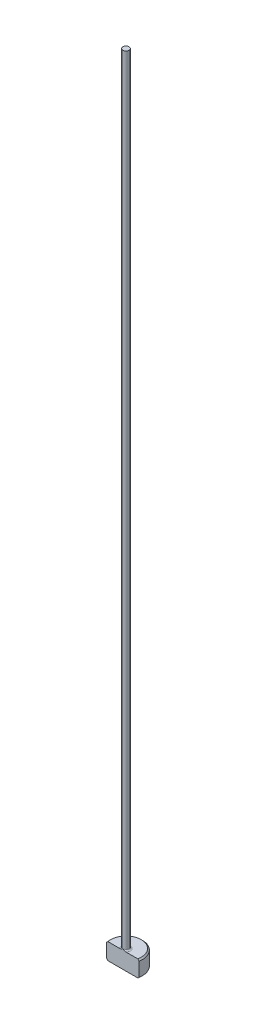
ISO-10303-21;
HEADER;
FILE_DESCRIPTION(('STEP AP214'),'2;1');
FILE_NAME('part.step','',(''),(''),'','','');
FILE_SCHEMA(('AUTOMOTIVE_DESIGN { 1 0 10303 214 1 1 1 1 }'));
ENDSEC;
DATA;
#1=APPLICATION_CONTEXT('core data for automotive mechanical design processes');
#2=APPLICATION_PROTOCOL_DEFINITION('international standard','automotive_design',2000,#1);
#3=PRODUCT_CONTEXT('',#1,'mechanical');
#4=PRODUCT('Part','Part','',(#3));
#5=PRODUCT_RELATED_PRODUCT_CATEGORY('part','',(#4));
#6=PRODUCT_DEFINITION_FORMATION('','',#4);
#7=PRODUCT_DEFINITION_CONTEXT('part definition',#1,'design');
#8=PRODUCT_DEFINITION('design','',#6,#7);
#9=PRODUCT_DEFINITION_SHAPE('','',#8);
#10=(LENGTH_UNIT() NAMED_UNIT(*) SI_UNIT(.MILLI.,.METRE.));
#11=(NAMED_UNIT(*) PLANE_ANGLE_UNIT() SI_UNIT($,.RADIAN.));
#12=(NAMED_UNIT(*) SI_UNIT($,.STERADIAN.) SOLID_ANGLE_UNIT());
#13=UNCERTAINTY_MEASURE_WITH_UNIT(LENGTH_MEASURE(1.E-05),#10,'distance_accuracy_value','');
#14=(GEOMETRIC_REPRESENTATION_CONTEXT(3) GLOBAL_UNCERTAINTY_ASSIGNED_CONTEXT((#13)) GLOBAL_UNIT_ASSIGNED_CONTEXT((#10,
#11,#12)) REPRESENTATION_CONTEXT('',''));
#15=CARTESIAN_POINT('',(0.,0.,0.));
#16=DIRECTION('',(0.,0.,1.));
#17=DIRECTION('',(1.,0.,0.));
#18=AXIS2_PLACEMENT_3D('',#15,#16,#17);
#19=CARTESIAN_POINT('',(0.,0.,0.));
#20=DIRECTION('',(0.,-1.,0.));
#21=DIRECTION('',(0.,0.,-1.));
#22=AXIS2_PLACEMENT_3D('',#19,#20,#21);
#23=PLANE('',#22);
#24=CARTESIAN_POINT('',(0.,0.,0.));
#25=DIRECTION('',(0.,-1.,0.));
#26=DIRECTION('',(0.,0.,-1.));
#27=AXIS2_PLACEMENT_3D('',#24,#25,#26);
#28=CIRCLE('',#27,2.92099999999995);
#29=CARTESIAN_POINT('',(-2.85989111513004,0.,0.594359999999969));
#30=VERTEX_POINT('',#29);
#31=CARTESIAN_POINT('',(2.85989111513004,0.,0.594359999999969));
#32=VERTEX_POINT('',#31);
#33=EDGE_CURVE('E98',#30,#32,#28,.T.);
#34=ORIENTED_EDGE('',*,*,#33,.T.);
#35=DIRECTION('',(-1.,0.,0.));
#36=VECTOR('',#35,1.);
#37=CARTESIAN_POINT('',(-3.11887178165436,0.,0.594359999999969));
#38=LINE('',#37,#36);
#39=EDGE_CURVE('E83',#32,#30,#38,.T.);
#40=ORIENTED_EDGE('',*,*,#39,.T.);
#41=EDGE_LOOP('',(#34,#40));
#42=FACE_BOUND('',#41,.T.);
#43=ADVANCED_FACE('F32',(#42),#23,.T.);
#44=CARTESIAN_POINT('',(0.,259.958771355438,0.));
#45=DIRECTION('',(0.,1.,0.));
#46=DIRECTION('',(0.,0.,1.));
#47=AXIS2_PLACEMENT_3D('',#44,#45,#46);
#48=CYLINDRICAL_SURFACE('',#47,3.17499999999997);
#49=CARTESIAN_POINT('',(0.,2.92099999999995,0.));
#50=DIRECTION('',(0.,1.,0.));
#51=DIRECTION('',(0.,0.,1.));
#52=AXIS2_PLACEMENT_3D('',#49,#50,#51);
#53=CIRCLE('',#52,3.17499999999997);
#54=CARTESIAN_POINT('',(-3.11887178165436,2.92099999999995,0.594359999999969));
#55=VERTEX_POINT('',#54);
#56=CARTESIAN_POINT('',(3.11887178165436,2.92099999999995,0.594359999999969));
#57=VERTEX_POINT('',#56);
#58=EDGE_CURVE('E104',#55,#57,#53,.F.);
#59=ORIENTED_EDGE('',*,*,#58,.T.);
#60=DIRECTION('',(0.,-1.,0.));
#61=VECTOR('',#60,1.);
#62=CARTESIAN_POINT('',(3.11887178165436,152.4,0.594359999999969));
#63=LINE('',#62,#61);
#64=CARTESIAN_POINT('',(3.11887178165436,0.254000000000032,0.594359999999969));
#65=VERTEX_POINT('',#64);
#66=EDGE_CURVE('E183',#57,#65,#63,.T.);
#67=ORIENTED_EDGE('',*,*,#66,.T.);
#68=CARTESIAN_POINT('',(0.,0.254000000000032,0.));
#69=DIRECTION('',(0.,-1.,0.));
#70=DIRECTION('',(0.,0.,-1.));
#71=AXIS2_PLACEMENT_3D('',#68,#69,#70);
#72=CIRCLE('',#71,3.17499999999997);
#73=CARTESIAN_POINT('',(-3.11887178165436,0.254000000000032,0.594359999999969));
#74=VERTEX_POINT('',#73);
#75=EDGE_CURVE('E100',#65,#74,#72,.F.);
#76=ORIENTED_EDGE('',*,*,#75,.T.);
#77=DIRECTION('',(0.,-1.,0.));
#78=VECTOR('',#77,1.);
#79=CARTESIAN_POINT('',(-3.11887178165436,152.4,0.594359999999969));
#80=LINE('',#79,#78);
#81=EDGE_CURVE('E93',#55,#74,#80,.T.);
#82=ORIENTED_EDGE('',*,*,#81,.F.);
#83=EDGE_LOOP('',(#59,#67,#76,#82));
#84=FACE_BOUND('',#83,.T.);
#85=ADVANCED_FACE('F158',(#84),#48,.T.);
#86=CARTESIAN_POINT('',(-3.17499999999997,3.175,0.));
#87=DIRECTION('',(0.,1.,0.));
#88=DIRECTION('',(0.,0.,1.));
#89=AXIS2_PLACEMENT_3D('',#86,#87,#88);
#90=PLANE('',#89);
#91=CARTESIAN_POINT('',(0.,3.175,0.));
#92=DIRECTION('',(0.,1.,0.));
#93=DIRECTION('',(0.,0.,1.));
#94=AXIS2_PLACEMENT_3D('',#91,#92,#93);
#95=CIRCLE('',#94,2.92099999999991);
#96=CARTESIAN_POINT('',(2.85989111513,3.175,0.594359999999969));
#97=VERTEX_POINT('',#96);
#98=CARTESIAN_POINT('',(-2.85989111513,3.175,0.594359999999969));
#99=VERTEX_POINT('',#98);
#100=EDGE_CURVE('E178',#97,#99,#95,.T.);
#101=ORIENTED_EDGE('',*,*,#100,.T.);
#102=DIRECTION('',(1.,0.,0.));
#103=VECTOR('',#102,1.);
#104=CARTESIAN_POINT('',(-3.17499999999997,3.175,0.594359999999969));
#105=LINE('',#104,#103);
#106=CARTESIAN_POINT('',(-0.605351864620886,3.17500000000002,0.594359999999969));
#107=VERTEX_POINT('',#106);
#108=EDGE_CURVE('E57',#99,#107,#105,.T.);
#109=ORIENTED_EDGE('',*,*,#108,.T.);
#110=CARTESIAN_POINT('',(0.,3.175,0.));
#111=DIRECTION('',(0.,1.,0.));
#112=DIRECTION('',(0.,0.,1.));
#113=AXIS2_PLACEMENT_3D('',#110,#111,#112);
#114=CIRCLE('',#113,0.848359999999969);
#115=CARTESIAN_POINT('',(0.605351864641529,3.17500000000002,0.594359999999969));
#116=VERTEX_POINT('',#115);
#117=EDGE_CURVE('E107',#107,#116,#114,.F.);
#118=ORIENTED_EDGE('',*,*,#117,.T.);
#119=EDGE_CURVE('E136',#116,#97,#105,.T.);
#120=ORIENTED_EDGE('',*,*,#119,.T.);
#121=EDGE_LOOP('',(#101,#109,#118,#120));
#122=FACE_BOUND('',#121,.T.);
#123=ADVANCED_FACE('F147',(#122),#90,.T.);
#124=CARTESIAN_POINT('',(0.,3.17499999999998,0.));
#125=DIRECTION('',(0.,-1.,0.));
#126=DIRECTION('',(0.,0.,-1.));
#127=AXIS2_PLACEMENT_3D('',#124,#125,#126);
#128=CONICAL_SURFACE('',#127,2.92099999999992,0.785398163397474);
#129=ORIENTED_EDGE('',*,*,#58,.F.);
#130=CARTESIAN_POINT('',(-6.8648194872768,-0.794501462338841,0.594359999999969));
#131=CARTESIAN_POINT('',(-6.6191711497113,-0.549776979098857,0.594359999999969));
#132=CARTESIAN_POINT('',(-6.37348172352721,-0.305093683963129,0.594359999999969));
#133=CARTESIAN_POINT('',(-5.88194851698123,0.184148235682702,0.594359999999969));
#134=CARTESIAN_POINT('',(-5.63610472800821,0.428706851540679,0.594359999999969));
#135=CARTESIAN_POINT('',(-5.14385611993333,0.917989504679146,0.594359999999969));
#136=CARTESIAN_POINT('',(-4.89745100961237,1.16271324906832,0.594359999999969));
#137=CARTESIAN_POINT('',(-4.40434968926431,1.65183765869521,0.594359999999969));
#138=CARTESIAN_POINT('',(-4.15765349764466,1.89623834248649,0.594359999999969));
#139=CARTESIAN_POINT('',(-3.67893599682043,2.36952748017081,0.594359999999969));
#140=CARTESIAN_POINT('',(-3.44694459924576,2.59844615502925,0.594359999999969));
#141=CARTESIAN_POINT('',(-3.09833846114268,2.94123712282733,0.594359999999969));
#142=CARTESIAN_POINT('',(-2.9820226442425,3.05541328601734,0.594359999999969));
#143=CARTESIAN_POINT('',(-2.74910931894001,3.28347396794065,0.594359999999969));
#144=CARTESIAN_POINT('',(-2.63251181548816,3.3973584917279,0.594359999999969));
#145=CARTESIAN_POINT('',(-2.39900931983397,3.62460667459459,0.594359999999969));
#146=CARTESIAN_POINT('',(-2.28210468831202,3.73797070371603,0.594359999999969));
#147=CARTESIAN_POINT('',(-2.04765692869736,3.96405258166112,0.594359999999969));
#148=CARTESIAN_POINT('',(-1.93011375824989,4.07677038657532,0.594359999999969));
#149=CARTESIAN_POINT('',(-1.69404304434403,4.30110221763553,0.594359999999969));
#150=CARTESIAN_POINT('',(-1.57551582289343,4.412716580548,0.594359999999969));
#151=CARTESIAN_POINT('',(-1.39631926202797,4.57860871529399,0.594359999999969));
#152=CARTESIAN_POINT('',(-1.33635609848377,4.63364822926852,0.594359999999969));
#153=CARTESIAN_POINT('',(-1.21575339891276,4.74298001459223,0.594359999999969));
#154=CARTESIAN_POINT('',(-1.15511388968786,4.7972723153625,0.594359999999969));
#155=CARTESIAN_POINT('',(-1.05978852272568,4.88102982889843,0.594359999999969));
#156=CARTESIAN_POINT('',(-1.02544763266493,4.91088723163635,0.594359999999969));
#157=CARTESIAN_POINT('',(-0.95635921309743,4.9701360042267,0.594359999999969));
#158=CARTESIAN_POINT('',(-0.921611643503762,4.99952732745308,0.594359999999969));
#159=CARTESIAN_POINT('',(-0.851219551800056,5.05799717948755,0.594359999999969));
#160=CARTESIAN_POINT('',(-0.815569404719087,5.08706896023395,0.594359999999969));
#161=CARTESIAN_POINT('',(-0.743573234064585,5.14432373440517,0.594359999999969));
#162=CARTESIAN_POINT('',(-0.707227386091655,5.17250694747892,0.594359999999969));
#163=CARTESIAN_POINT('',(-0.633142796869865,5.22794418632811,0.594359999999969));
#164=CARTESIAN_POINT('',(-0.595392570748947,5.25518299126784,0.594359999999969));
#165=CARTESIAN_POINT('',(-0.518500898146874,5.30776394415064,0.594359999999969));
#166=CARTESIAN_POINT('',(-0.479357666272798,5.33310351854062,0.594359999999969));
#167=CARTESIAN_POINT('',(-0.399651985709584,5.38048073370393,0.594359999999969));
#168=CARTESIAN_POINT('',(-0.359109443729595,5.40255109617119,0.594359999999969));
#169=CARTESIAN_POINT('',(-0.275782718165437,5.44180529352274,0.594359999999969));
#170=CARTESIAN_POINT('',(-0.233006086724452,5.45900447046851,0.594359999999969));
#171=CARTESIAN_POINT('',(-0.148687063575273,5.48450569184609,0.594359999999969));
#172=CARTESIAN_POINT('',(-0.107352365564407,5.49344321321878,0.594359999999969));
#173=CARTESIAN_POINT('',(-0.0447378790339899,5.50032302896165,0.594359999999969));
#174=CARTESIAN_POINT('',(-0.0238027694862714,5.50153223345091,0.594359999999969));
#175=CARTESIAN_POINT('',(0.0180770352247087,5.50173397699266,0.594359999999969));
#176=CARTESIAN_POINT('',(0.0390217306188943,5.50072645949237,0.594359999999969));
#177=CARTESIAN_POINT('',(0.101294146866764,5.49447119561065,0.594359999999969));
#178=CARTESIAN_POINT('',(0.142325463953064,5.48601867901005,0.594359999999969));
#179=CARTESIAN_POINT('',(0.202429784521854,5.46841556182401,0.594359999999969));
#180=CARTESIAN_POINT('',(0.222297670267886,5.46169167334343,0.594359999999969));
#181=CARTESIAN_POINT('',(0.261527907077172,5.44689786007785,0.594359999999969));
#182=CARTESIAN_POINT('',(0.280890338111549,5.43882814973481,0.594359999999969));
#183=CARTESIAN_POINT('',(0.334163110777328,5.41482918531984,0.594359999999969));
#184=CARTESIAN_POINT('',(0.367533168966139,5.39771168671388,0.594359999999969));
#185=CARTESIAN_POINT('',(0.432986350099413,5.36114954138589,0.594359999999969));
#186=CARTESIAN_POINT('',(0.465067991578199,5.34170231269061,0.594359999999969));
#187=CARTESIAN_POINT('',(0.528309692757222,5.30115132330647,0.594359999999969));
#188=CARTESIAN_POINT('',(0.559466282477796,5.28004220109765,0.594359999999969));
#189=CARTESIAN_POINT('',(0.620984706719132,5.2366907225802,0.594359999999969));
#190=CARTESIAN_POINT('',(0.651346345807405,5.21444809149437,0.594359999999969));
#191=CARTESIAN_POINT('',(0.742070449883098,5.14609257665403,0.594359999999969));
#192=CARTESIAN_POINT('',(0.801494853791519,5.09874004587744,0.594359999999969));
#193=CARTESIAN_POINT('',(0.918675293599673,5.002317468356,0.594359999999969));
#194=CARTESIAN_POINT('',(0.976434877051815,4.95325165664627,0.594359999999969));
#195=CARTESIAN_POINT('',(1.08971968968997,4.85504334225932,0.594359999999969));
#196=CARTESIAN_POINT('',(1.1452662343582,4.80592537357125,0.594359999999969));
#197=CARTESIAN_POINT('',(1.25569925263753,4.70695340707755,0.594359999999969));
#198=CARTESIAN_POINT('',(1.31058570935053,4.65709939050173,0.594359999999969));
#199=CARTESIAN_POINT('',(1.474563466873,4.5067643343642,0.594359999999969));
#200=CARTESIAN_POINT('',(1.58295757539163,4.40552404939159,0.594359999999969));
#201=CARTESIAN_POINT('',(1.79884367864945,4.20183719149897,0.594359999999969));
#202=CARTESIAN_POINT('',(1.9063344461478,4.09938932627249,0.594359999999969));
#203=CARTESIAN_POINT('',(2.1206627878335,3.89382966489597,0.594359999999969));
#204=CARTESIAN_POINT('',(2.22750041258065,3.79071792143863,0.594359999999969));
#205=CARTESIAN_POINT('',(2.43977439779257,3.58500662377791,0.594359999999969));
#206=CARTESIAN_POINT('',(2.54521462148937,3.48241104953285,0.594359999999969));
#207=CARTESIAN_POINT('',(2.75580702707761,3.27692056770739,0.594359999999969));
#208=CARTESIAN_POINT('',(2.86095920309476,3.17402565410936,0.594359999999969));
#209=CARTESIAN_POINT('',(3.17601133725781,2.86511932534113,0.594359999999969));
#210=CARTESIAN_POINT('',(3.38560260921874,2.65879322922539,0.594359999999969));
#211=CARTESIAN_POINT('',(3.86691725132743,2.18392087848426,0.594359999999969));
#212=CARTESIAN_POINT('',(4.13848251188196,1.91521456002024,0.594359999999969));
#213=CARTESIAN_POINT('',(4.6812293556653,1.37732631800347,0.594359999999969));
#214=CARTESIAN_POINT('',(4.95241086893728,1.10814432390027,0.594359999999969));
#215=CARTESIAN_POINT('',(5.49725341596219,0.566796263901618,0.594359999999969));
#216=CARTESIAN_POINT('',(5.77091180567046,0.29462753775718,0.594359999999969));
#217=CARTESIAN_POINT('',(6.31800243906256,-0.249845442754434,0.594359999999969));
#218=CARTESIAN_POINT('',(6.59143471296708,-0.522149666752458,0.594359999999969));
#219=CARTESIAN_POINT('',(6.8648194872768,-0.794501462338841,0.594359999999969));
#220=B_SPLINE_CURVE_WITH_KNOTS('',3,(#130,#131,#132,#133,#134,#135,#136,#137,#138,#139,#140,
#141,#142,#143,#144,#145,#146,#147,#148,#149,#150,#151,#152,#153,#154,#155,#156,#157,#158,#159,
#160,#161,#162,#163,#164,#165,#166,#167,#168,#169,#170,#171,#172,#173,#174,#175,#176,#177,#178,
#179,#180,#181,#182,#183,#184,#185,#186,#187,#188,#189,#190,#191,#192,#193,#194,#195,#196,#197,
#198,#199,#200,#201,#202,#203,#204,#205,#206,#207,#208,#209,#210,#211,#212,#213,#214,#215,#216,
#217,#218,#219),.UNSPECIFIED.,.F.,.F.,(4,2,2,2,2,2,2,2,2,2,2,2,2,2,2,2,2,2,2,2,2,2,2,2,2,2,2,2,
2,2,2,2,2,2,2,2,2,2,2,2,2,2,2,2,4),(0.,1.04023973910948,2.0805438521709,3.12239139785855,
4.16417625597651,5.14193457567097,5.63090260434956,6.11986210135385,6.60839150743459,
7.09695372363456,7.58536191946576,7.8295393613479,8.0737071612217,8.21022095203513,
8.34674831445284,8.48474175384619,8.62270081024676,8.76231642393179,8.90211792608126,
9.04040873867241,9.17825902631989,9.3043114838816,9.3671106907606,9.42991149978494,
9.55472897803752,9.61762313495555,9.68050727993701,9.79286939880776,9.90535721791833,
10.0182241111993,10.131118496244,10.3589904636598,10.5863342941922,10.8087690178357,
11.0312094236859,11.4761525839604,11.9216253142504,12.3670631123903,12.8084142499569,
13.2497743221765,14.1320939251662,15.2781982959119,16.4244899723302,17.5823683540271,
18.7400526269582),.UNSPECIFIED.);
#221=EDGE_CURVE('E135',#55,#99,#220,.T.);
#222=ORIENTED_EDGE('',*,*,#221,.T.);
#223=ORIENTED_EDGE('',*,*,#100,.F.);
#224=EDGE_CURVE('E127',#97,#57,#220,.T.);
#225=ORIENTED_EDGE('',*,*,#224,.T.);
#226=EDGE_LOOP('',(#129,#222,#223,#225));
#227=FACE_BOUND('',#226,.T.);
#228=ADVANCED_FACE('F143',(#227),#128,.T.);
#229=CARTESIAN_POINT('',(0.,0.254000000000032,0.));
#230=DIRECTION('',(0.,1.,0.));
#231=DIRECTION('',(0.,0.,1.));
#232=AXIS2_PLACEMENT_3D('',#229,#230,#231);
#233=CONICAL_SURFACE('',#232,3.17499999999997,0.785398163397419);
#234=ORIENTED_EDGE('',*,*,#75,.F.);
#235=CARTESIAN_POINT('',(6.8648194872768,3.96950146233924,0.594359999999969));
#236=CARTESIAN_POINT('',(6.61917114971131,3.72477697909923,0.594359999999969));
#237=CARTESIAN_POINT('',(6.37348172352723,3.48009368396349,0.594359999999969));
#238=CARTESIAN_POINT('',(5.88194851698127,2.99085176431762,0.594359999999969));
#239=CARTESIAN_POINT('',(5.63610472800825,2.74629314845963,0.594359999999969));
#240=CARTESIAN_POINT('',(5.14385611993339,2.25701049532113,0.594359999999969));
#241=CARTESIAN_POINT('',(4.89745100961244,2.01228675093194,0.594359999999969));
#242=CARTESIAN_POINT('',(4.4043496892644,1.52316234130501,0.594359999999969));
#243=CARTESIAN_POINT('',(4.15765349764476,1.27876165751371,0.594359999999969));
#244=CARTESIAN_POINT('',(3.67893599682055,0.805472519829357,0.594359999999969));
#245=CARTESIAN_POINT('',(3.44694459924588,0.576553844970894,0.594359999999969));
#246=CARTESIAN_POINT('',(3.09833846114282,0.233762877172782,0.594359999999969));
#247=CARTESIAN_POINT('',(2.98202264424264,0.119586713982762,0.594359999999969));
#248=CARTESIAN_POINT('',(2.74910931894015,-0.108473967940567,0.594359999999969));
#249=CARTESIAN_POINT('',(2.6325118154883,-0.222358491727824,0.594359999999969));
#250=CARTESIAN_POINT('',(2.39900931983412,-0.44960667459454,0.594359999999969));
#251=CARTESIAN_POINT('',(2.28210468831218,-0.562970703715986,0.594359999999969));
#252=CARTESIAN_POINT('',(2.04765692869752,-0.789052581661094,0.594359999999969));
#253=CARTESIAN_POINT('',(1.93011375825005,-0.901770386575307,0.594359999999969));
#254=CARTESIAN_POINT('',(1.6940430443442,-1.12610221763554,0.594359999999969));
#255=CARTESIAN_POINT('',(1.5755158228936,-1.23771658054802,0.594359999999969));
#256=CARTESIAN_POINT('',(1.39631926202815,-1.40360871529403,0.594359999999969));
#257=CARTESIAN_POINT('',(1.33635609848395,-1.45864822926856,0.594359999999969));
#258=CARTESIAN_POINT('',(1.21575339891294,-1.56798001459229,0.594359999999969));
#259=CARTESIAN_POINT('',(1.15511388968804,-1.62227231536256,0.594359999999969));
#260=CARTESIAN_POINT('',(1.05978852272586,-1.7060298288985,0.594359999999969));
#261=CARTESIAN_POINT('',(1.02544763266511,-1.73588723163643,0.594359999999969));
#262=CARTESIAN_POINT('',(0.956359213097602,-1.7951360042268,0.594359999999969));
#263=CARTESIAN_POINT('',(0.92161164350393,-1.82452732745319,0.594359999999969));
#264=CARTESIAN_POINT('',(0.851219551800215,-1.88299717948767,0.594359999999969));
#265=CARTESIAN_POINT('',(0.815569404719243,-1.91206896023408,0.594359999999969));
#266=CARTESIAN_POINT('',(0.743573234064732,-1.96932373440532,0.594359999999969));
#267=CARTESIAN_POINT('',(0.707227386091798,-1.99750694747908,0.594359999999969));
#268=CARTESIAN_POINT('',(0.633142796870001,-2.05294418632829,0.594359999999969));
#269=CARTESIAN_POINT('',(0.595392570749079,-2.08018299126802,0.594359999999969));
#270=CARTESIAN_POINT('',(0.518500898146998,-2.13276394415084,0.594359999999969));
#271=CARTESIAN_POINT('',(0.479357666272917,-2.15810351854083,0.594359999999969));
#272=CARTESIAN_POINT('',(0.399651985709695,-2.20548073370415,0.594359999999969));
#273=CARTESIAN_POINT('',(0.359109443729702,-2.22755109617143,0.594359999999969));
#274=CARTESIAN_POINT('',(0.275782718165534,-2.26680529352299,0.594359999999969));
#275=CARTESIAN_POINT('',(0.233006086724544,-2.28400447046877,0.594359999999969));
#276=CARTESIAN_POINT('',(0.14868706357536,-2.30950569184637,0.594359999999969));
#277=CARTESIAN_POINT('',(0.107352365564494,-2.31844321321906,0.594359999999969));
#278=CARTESIAN_POINT('',(0.0447378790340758,-2.32532302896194,0.594359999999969));
#279=CARTESIAN_POINT('',(0.0238027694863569,-2.32653223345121,0.594359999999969));
#280=CARTESIAN_POINT('',(-0.0180770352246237,-2.32673397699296,0.594359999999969));
#281=CARTESIAN_POINT('',(-0.0390217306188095,-2.32572645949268,0.594359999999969));
#282=CARTESIAN_POINT('',(-0.101294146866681,-2.31947119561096,0.594359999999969));
#283=CARTESIAN_POINT('',(-0.142325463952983,-2.31101867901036,0.594359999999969));
#284=CARTESIAN_POINT('',(-0.202429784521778,-2.29341556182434,0.594359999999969));
#285=CARTESIAN_POINT('',(-0.222297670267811,-2.28669167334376,0.594359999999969));
#286=CARTESIAN_POINT('',(-0.261527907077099,-2.27189786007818,0.594359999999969));
#287=CARTESIAN_POINT('',(-0.280890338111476,-2.26382814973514,0.594359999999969));
#288=CARTESIAN_POINT('',(-0.334163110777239,-2.23982918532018,0.594359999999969));
#289=CARTESIAN_POINT('',(-0.367533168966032,-2.22271168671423,0.594359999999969));
#290=CARTESIAN_POINT('',(-0.432986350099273,-2.18614954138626,0.594359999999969));
#291=CARTESIAN_POINT('',(-0.465067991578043,-2.16670231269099,0.594359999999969));
#292=CARTESIAN_POINT('',(-0.528309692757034,-2.12615132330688,0.594359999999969));
#293=CARTESIAN_POINT('',(-0.559466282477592,-2.10504220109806,0.594359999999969));
#294=CARTESIAN_POINT('',(-0.620984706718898,-2.06169072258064,0.594359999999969));
#295=CARTESIAN_POINT('',(-0.651346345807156,-2.03944809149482,0.594359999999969));
#296=CARTESIAN_POINT('',(-0.742070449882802,-1.97109257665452,0.594359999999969));
#297=CARTESIAN_POINT('',(-0.801494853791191,-1.92374004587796,0.594359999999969));
#298=CARTESIAN_POINT('',(-0.918675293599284,-1.82731746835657,0.594359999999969));
#299=CARTESIAN_POINT('',(-0.976434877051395,-1.77825165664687,0.594359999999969));
#300=CARTESIAN_POINT('',(-1.08971968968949,-1.68004334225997,0.594359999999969));
#301=CARTESIAN_POINT('',(-1.14526623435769,-1.63092537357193,0.594359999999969));
#302=CARTESIAN_POINT('',(-1.25569925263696,-1.53195340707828,0.594359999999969));
#303=CARTESIAN_POINT('',(-1.31058570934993,-1.48209939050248,0.594359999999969));
#304=CARTESIAN_POINT('',(-1.47456346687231,-1.33176433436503,0.594359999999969));
#305=CARTESIAN_POINT('',(-1.58295757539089,-1.23052404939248,0.594359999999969));
#306=CARTESIAN_POINT('',(-1.79884367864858,-1.02683719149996,0.594359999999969));
#307=CARTESIAN_POINT('',(-1.90633444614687,-0.924389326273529,0.594359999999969));
#308=CARTESIAN_POINT('',(-2.12066278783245,-0.718829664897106,0.594359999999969));
#309=CARTESIAN_POINT('',(-2.22750041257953,-0.615717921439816,0.594359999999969));
#310=CARTESIAN_POINT('',(-2.43977439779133,-0.410006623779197,0.594359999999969));
#311=CARTESIAN_POINT('',(-2.54521462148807,-0.307411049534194,0.594359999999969));
#312=CARTESIAN_POINT('',(-2.75580702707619,-0.101920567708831,0.594359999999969));
#313=CARTESIAN_POINT('',(-2.86095920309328,0.000974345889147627,0.594359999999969));
#314=CARTESIAN_POINT('',(-3.17601133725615,0.309880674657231,0.594359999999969));
#315=CARTESIAN_POINT('',(-3.38560260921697,0.516206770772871,0.594359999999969));
#316=CARTESIAN_POINT('',(-3.86691725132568,0.991079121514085,0.594359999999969));
#317=CARTESIAN_POINT('',(-4.13848251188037,1.25978543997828,0.594359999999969));
#318=CARTESIAN_POINT('',(-4.68122935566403,1.79767368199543,0.594359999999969));
#319=CARTESIAN_POINT('',(-4.95241086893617,2.0668556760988,0.594359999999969));
#320=CARTESIAN_POINT('',(-5.49725341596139,2.60820373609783,0.594359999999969));
#321=CARTESIAN_POINT('',(-5.77091180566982,2.88037246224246,0.594359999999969));
#322=CARTESIAN_POINT('',(-6.31800243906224,3.42484544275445,0.594359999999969));
#323=CARTESIAN_POINT('',(-6.59143471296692,3.69714966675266,0.594359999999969));
#324=CARTESIAN_POINT('',(-6.8648194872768,3.96950146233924,0.594359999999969));
#325=B_SPLINE_CURVE_WITH_KNOTS('',3,(#235,#236,#237,#238,#239,#240,#241,#242,#243,#244,#245,
#246,#247,#248,#249,#250,#251,#252,#253,#254,#255,#256,#257,#258,#259,#260,#261,#262,#263,#264,
#265,#266,#267,#268,#269,#270,#271,#272,#273,#274,#275,#276,#277,#278,#279,#280,#281,#282,#283,
#284,#285,#286,#287,#288,#289,#290,#291,#292,#293,#294,#295,#296,#297,#298,#299,#300,#301,#302,
#303,#304,#305,#306,#307,#308,#309,#310,#311,#312,#313,#314,#315,#316,#317,#318,#319,#320,#321,
#322,#323,#324),.UNSPECIFIED.,.F.,.F.,(4,2,2,2,2,2,2,2,2,2,2,2,2,2,2,2,2,2,2,2,2,2,2,2,2,2,2,2,
2,2,2,2,2,2,2,2,2,2,2,2,2,2,2,2,4),(0.,1.0402397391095,2.08054385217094,3.12239139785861,
4.16417625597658,5.14193457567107,5.63090260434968,6.11986210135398,6.60839150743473,
7.09695372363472,7.58536191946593,7.82953936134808,8.07370716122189,8.21022095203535,
8.34674831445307,8.48474175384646,8.62270081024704,8.7623164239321,8.9021179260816,
9.04040873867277,9.17825902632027,9.30431148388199,9.36711069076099,9.42991149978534,
9.55472897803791,9.61762313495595,9.68050727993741,9.7928693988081,9.9053572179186,
10.0182241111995,10.1311184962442,10.3589904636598,10.5863342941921,10.8087690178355,
11.0312094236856,11.4761525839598,11.9216253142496,12.3670631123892,12.8084142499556,
13.249774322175,14.1320939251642,15.2781982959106,16.4244899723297,17.5823683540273,
18.7400526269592),.UNSPECIFIED.);
#326=EDGE_CURVE('E86',#65,#32,#325,.T.);
#327=ORIENTED_EDGE('',*,*,#326,.T.);
#328=ORIENTED_EDGE('',*,*,#33,.F.);
#329=EDGE_CURVE('E89',#30,#74,#325,.T.);
#330=ORIENTED_EDGE('',*,*,#329,.T.);
#331=EDGE_LOOP('',(#234,#327,#328,#330));
#332=FACE_BOUND('',#331,.T.);
#333=ADVANCED_FACE('F97',(#332),#233,.T.);
#334=CARTESIAN_POINT('',(0.,3.42900000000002,0.));
#335=DIRECTION('',(0.,1.,0.));
#336=DIRECTION('',(0.,0.,1.));
#337=AXIS2_PLACEMENT_3D('',#334,#335,#336);
#338=TOROIDAL_SURFACE('',#337,0.848359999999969,0.254);
#339=CARTESIAN_POINT('',(0.,3.42900000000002,0.594359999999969));
#340=CARTESIAN_POINT('',(1.36452493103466E-10,3.42900060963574,0.594359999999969));
#341=CARTESIAN_POINT('',(6.87113849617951E-08,3.42900121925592,0.594359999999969));
#342=CARTESIAN_POINT('',(3.08798581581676E-07,3.42900241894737,0.594359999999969));
#343=CARTESIAN_POINT('',(4.80878842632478E-07,3.42900300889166,0.594359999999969));
#344=CARTESIAN_POINT('',(9.06047527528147E-07,3.42900417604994,0.594359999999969));
#345=CARTESIAN_POINT('',(1.16117830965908E-06,3.42900475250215,0.594359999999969));
#346=CARTESIAN_POINT('',(1.7312208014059E-06,3.42900587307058,0.594359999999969));
#347=CARTESIAN_POINT('',(2.04604621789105E-06,3.42900641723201,0.594359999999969));
#348=CARTESIAN_POINT('',(3.12035972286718E-06,3.42900811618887,0.594359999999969));
#349=CARTESIAN_POINT('',(3.9602357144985E-06,3.42900922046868,0.594359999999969));
#350=CARTESIAN_POINT('',(5.76398603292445E-06,3.42901129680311,0.594359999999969));
#351=CARTESIAN_POINT('',(6.72655427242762E-06,3.42901227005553,0.594359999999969));
#352=CARTESIAN_POINT('',(1.02054838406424E-05,3.42901557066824,0.594359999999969));
#353=CARTESIAN_POINT('',(1.2881024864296E-05,3.42901773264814,0.594359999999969));
#354=CARTESIAN_POINT('',(1.83808505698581E-05,3.42902157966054,0.594359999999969));
#355=CARTESIAN_POINT('',(2.11946408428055E-05,3.4290232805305,0.594359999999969));
#356=CARTESIAN_POINT('',(3.22646354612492E-05,3.42902979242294,0.594359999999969));
#357=CARTESIAN_POINT('',(4.0665581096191E-05,3.42903434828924,0.594359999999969));
#358=CARTESIAN_POINT('',(5.69174548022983E-05,3.42904231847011,0.594359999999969));
#359=CARTESIAN_POINT('',(6.47335102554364E-05,3.4290458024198,0.594359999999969));
#360=CARTESIAN_POINT('',(0.00011698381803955,3.42907110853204,0.594359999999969));
#361=CARTESIAN_POINT('',(0.000157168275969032,3.42910070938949,0.594359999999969));
#362=CARTESIAN_POINT('',(0.000307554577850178,3.42920674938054,0.594359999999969));
#363=CARTESIAN_POINT('',(0.000420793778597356,3.42927738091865,0.594359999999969));
#364=CARTESIAN_POINT('',(0.000839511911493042,3.42954315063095,0.594359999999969));
#365=CARTESIAN_POINT('',(0.00114189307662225,3.42974423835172,0.594359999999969));
#366=CARTESIAN_POINT('',(0.00232105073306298,3.43052379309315,0.594359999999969));
#367=CARTESIAN_POINT('',(0.00320118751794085,3.43109578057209,0.594359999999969));
#368=CARTESIAN_POINT('',(0.0234009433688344,3.4442284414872,0.594359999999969));
#369=CARTESIAN_POINT('',(0.0426795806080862,3.45687033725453,0.594359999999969));
#370=CARTESIAN_POINT('',(0.0808467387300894,3.4815179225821,0.594359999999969));
#371=CARTESIAN_POINT('',(0.0997303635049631,3.493531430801,0.594359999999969));
#372=CARTESIAN_POINT('',(0.139526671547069,3.5182608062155,0.594359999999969));
#373=CARTESIAN_POINT('',(0.160464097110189,3.53093743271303,0.594359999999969));
#374=CARTESIAN_POINT('',(0.202966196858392,3.55561064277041,0.594359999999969));
#375=CARTESIAN_POINT('',(0.224534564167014,3.56760092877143,0.594359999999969));
#376=CARTESIAN_POINT('',(0.263544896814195,3.58800713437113,0.594359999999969));
#377=CARTESIAN_POINT('',(0.280874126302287,3.59663639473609,0.594359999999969));
#378=CARTESIAN_POINT('',(0.315897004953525,3.61301779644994,0.594359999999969));
#379=CARTESIAN_POINT('',(0.333589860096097,3.62077164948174,0.594359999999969));
#380=CARTESIAN_POINT('',(0.386627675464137,3.64218550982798,0.594359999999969));
#381=CARTESIAN_POINT('',(0.422610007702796,3.65436787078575,0.594359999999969));
#382=CARTESIAN_POINT('',(0.486709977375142,3.67060231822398,0.594359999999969));
#383=CARTESIAN_POINT('',(0.514498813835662,3.67593446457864,0.594359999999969));
#384=CARTESIAN_POINT('',(0.571596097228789,3.68263920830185,0.594359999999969));
#385=CARTESIAN_POINT('',(0.600923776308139,3.68386758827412,0.594359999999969));
#386=CARTESIAN_POINT('',(0.651436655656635,3.68128040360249,0.594359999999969));
#387=CARTESIAN_POINT('',(0.672684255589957,3.6787360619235,0.594359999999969));
#388=CARTESIAN_POINT('',(0.714355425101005,3.67034643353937,0.594359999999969));
#389=CARTESIAN_POINT('',(0.734784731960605,3.66453138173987,0.594359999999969));
#390=CARTESIAN_POINT('',(0.770139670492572,3.65086692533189,0.594359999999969));
#391=CARTESIAN_POINT('',(0.785325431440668,3.64369340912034,0.594359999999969));
#392=CARTESIAN_POINT('',(0.814359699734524,3.62695940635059,0.594359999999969));
#393=CARTESIAN_POINT('',(0.828207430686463,3.61739754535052,0.594359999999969));
#394=CARTESIAN_POINT('',(0.851880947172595,3.5976439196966,0.594359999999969));
#395=CARTESIAN_POINT('',(0.861995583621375,3.58779913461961,0.594359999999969));
#396=CARTESIAN_POINT('',(0.880456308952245,3.56656632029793,0.594359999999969));
#397=CARTESIAN_POINT('',(0.888803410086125,3.55517918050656,0.594359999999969));
#398=CARTESIAN_POINT('',(0.90338493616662,3.53102054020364,0.594359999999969));
#399=CARTESIAN_POINT('',(0.909606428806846,3.51824116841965,0.594359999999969));
#400=CARTESIAN_POINT('',(0.919516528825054,3.49173236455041,0.594359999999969));
#401=CARTESIAN_POINT('',(0.923206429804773,3.47800342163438,0.594359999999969));
#402=CARTESIAN_POINT('',(0.927581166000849,3.45158843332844,0.594359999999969));
#403=CARTESIAN_POINT('',(0.928545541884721,3.43894818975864,0.594359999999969));
#404=CARTESIAN_POINT('',(0.928228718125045,3.41369828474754,0.594359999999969));
#405=CARTESIAN_POINT('',(0.926948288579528,3.40108861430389,0.594359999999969));
#406=CARTESIAN_POINT('',(0.922316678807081,3.37684686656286,0.594359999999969));
#407=CARTESIAN_POINT('',(0.919060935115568,3.36519630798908,0.594359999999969));
#408=CARTESIAN_POINT('',(0.9107109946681,3.34257690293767,0.594359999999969));
#409=CARTESIAN_POINT('',(0.905616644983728,3.33160811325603,0.594359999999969));
#410=CARTESIAN_POINT('',(0.893565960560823,3.31018052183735,0.594359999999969));
#411=CARTESIAN_POINT('',(0.886544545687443,3.29975849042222,0.594359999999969));
#412=CARTESIAN_POINT('',(0.871013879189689,3.28009647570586,0.594359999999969));
#413=CARTESIAN_POINT('',(0.862504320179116,3.27085673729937,0.594359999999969));
#414=CARTESIAN_POINT('',(0.843279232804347,3.25272813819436,0.594359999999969));
#415=CARTESIAN_POINT('',(0.832424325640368,3.24398750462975,0.594359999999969));
#416=CARTESIAN_POINT('',(0.809577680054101,3.22813925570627,0.594359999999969));
#417=CARTESIAN_POINT('',(0.797584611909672,3.221033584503,0.594359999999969));
#418=CARTESIAN_POINT('',(0.767220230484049,3.20562204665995,0.594359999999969));
#419=CARTESIAN_POINT('',(0.748396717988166,3.19820249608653,0.594359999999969));
#420=CARTESIAN_POINT('',(0.709849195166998,3.18654279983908,0.594359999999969));
#421=CARTESIAN_POINT('',(0.690126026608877,3.182299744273,0.594359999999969));
#422=CARTESIAN_POINT('',(0.642991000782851,3.1755984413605,0.594359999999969));
#423=CARTESIAN_POINT('',(0.615407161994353,3.17436184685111,0.594359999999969));
#424=CARTESIAN_POINT('',(0.560055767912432,3.17625180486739,0.594359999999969));
#425=CARTESIAN_POINT('',(0.532291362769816,3.1794419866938,0.594359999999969));
#426=CARTESIAN_POINT('',(0.459632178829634,3.19262014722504,0.594359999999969));
#427=CARTESIAN_POINT('',(0.415300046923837,3.20567419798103,0.594359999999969));
#428=CARTESIAN_POINT('',(0.351889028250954,3.22956882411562,0.594359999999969));
#429=CARTESIAN_POINT('',(0.331782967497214,3.2379671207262,0.594359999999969));
#430=CARTESIAN_POINT('',(0.292195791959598,3.25586509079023,0.594359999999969));
#431=CARTESIAN_POINT('',(0.272711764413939,3.26535820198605,0.594359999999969));
#432=CARTESIAN_POINT('',(0.234326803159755,3.28516655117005,0.594359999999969));
#433=CARTESIAN_POINT('',(0.21542301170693,3.29547635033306,0.594359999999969));
#434=CARTESIAN_POINT('',(0.177623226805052,3.31696076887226,0.594359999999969));
#435=CARTESIAN_POINT('',(0.158734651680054,3.32814838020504,0.594359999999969));
#436=CARTESIAN_POINT('',(0.128027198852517,3.34686280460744,0.594359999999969));
#437=CARTESIAN_POINT('',(0.116122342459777,3.35425008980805,0.594359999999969));
#438=CARTESIAN_POINT('',(0.0924957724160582,3.36911021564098,0.594359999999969));
#439=CARTESIAN_POINT('',(0.0807733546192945,3.37658193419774,0.594359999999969));
#440=CARTESIAN_POINT('',(0.0583668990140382,3.39097763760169,0.594359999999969));
#441=CARTESIAN_POINT('',(0.0476784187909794,3.39789485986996,0.594359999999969));
#442=CARTESIAN_POINT('',(0.0260275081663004,3.41199960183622,0.594359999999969));
#443=CARTESIAN_POINT('',(0.0150662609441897,3.41918908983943,0.594359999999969));
#444=CARTESIAN_POINT('',(0.0032020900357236,3.42690372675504,0.594359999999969));
#445=CARTESIAN_POINT('',(0.00232278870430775,3.42747509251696,0.594359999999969));
#446=CARTESIAN_POINT('',(0.00114386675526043,3.4282544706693,0.594359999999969));
#447=CARTESIAN_POINT('',(0.000840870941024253,3.42845597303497,0.594359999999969));
#448=CARTESIAN_POINT('',(0.000421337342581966,3.42872225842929,0.594359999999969));
#449=CARTESIAN_POINT('',(0.000307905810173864,3.42879300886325,0.594359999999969));
#450=CARTESIAN_POINT('',(0.000157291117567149,3.42889921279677,0.594359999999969));
#451=CARTESIAN_POINT('',(0.000117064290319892,3.42892884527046,0.594359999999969));
#452=CARTESIAN_POINT('',(6.47604447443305E-05,3.42895417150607,0.594359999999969));
#453=CARTESIAN_POINT('',(5.69396530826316E-05,3.42895765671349,0.594359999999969));
#454=CARTESIAN_POINT('',(4.0678042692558E-05,3.42896563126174,0.594359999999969));
#455=CARTESIAN_POINT('',(3.22721968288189E-05,3.42897019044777,0.594359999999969));
#456=CARTESIAN_POINT('',(2.11966652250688E-05,3.42897670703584,0.594359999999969));
#457=CARTESIAN_POINT('',(1.83819551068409E-05,3.42897840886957,0.594359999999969));
#458=CARTESIAN_POINT('',(1.28805073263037E-05,3.42898225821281,0.594359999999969));
#459=CARTESIAN_POINT('',(1.02042801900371E-05,3.42898442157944,0.594359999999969));
#460=CARTESIAN_POINT('',(6.72475164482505E-06,3.42898772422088,0.594359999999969));
#461=CARTESIAN_POINT('',(5.76209631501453E-06,3.4289886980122,0.594359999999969));
#462=CARTESIAN_POINT('',(3.95828419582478E-06,3.428990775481,0.594359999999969));
#463=CARTESIAN_POINT('',(3.11843511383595E-06,3.42899188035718,0.594359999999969));
#464=CARTESIAN_POINT('',(2.04428922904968E-06,3.42899358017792,0.594359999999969));
#465=CARTESIAN_POINT('',(1.72953861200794E-06,3.42899412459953,0.594359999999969));
#466=CARTESIAN_POINT('',(1.15968942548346E-06,3.42899524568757,0.594359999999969));
#467=CARTESIAN_POINT('',(9.04677259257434E-07,3.42899582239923,0.594359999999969));
#468=CARTESIAN_POINT('',(4.79798753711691E-07,3.4289969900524,0.594359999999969));
#469=CARTESIAN_POINT('',(3.07887916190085E-07,3.42899758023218,0.594359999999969));
#470=CARTESIAN_POINT('',(6.82046386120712E-08,3.42899878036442,0.594359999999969));
#471=CARTESIAN_POINT('',(-1.36491507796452E-10,3.42899939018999,0.594359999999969));
#472=CARTESIAN_POINT('',(0.,3.42900000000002,0.594359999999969));
#473=B_SPLINE_CURVE_WITH_KNOTS('',3,(#339,#340,#341,#342,#343,#344,#345,#346,#347,#348,#349,
#350,#351,#352,#353,#354,#355,#356,#357,#358,#359,#360,#361,#362,#363,#364,#365,#366,#367,#368,
#369,#370,#371,#372,#373,#374,#375,#376,#377,#378,#379,#380,#381,#382,#383,#384,#385,#386,#387,
#388,#389,#390,#391,#392,#393,#394,#395,#396,#397,#398,#399,#400,#401,#402,#403,#404,#405,#406,
#407,#408,#409,#410,#411,#412,#413,#414,#415,#416,#417,#418,#419,#420,#421,#422,#423,#424,#425,
#426,#427,#428,#429,#430,#431,#432,#433,#434,#435,#436,#437,#438,#439,#440,#441,#442,#443,#444,
#445,#446,#447,#448,#449,#450,#451,#452,#453,#454,#455,#456,#457,#458,#459,#460,#461,#462,#463,
#464,#465,#466,#467,#468,#469,#470,#471,#472),.UNSPECIFIED.,.T.,.F.,(4,2,2,2,2,2,2,2,2,2,2,2,2,
2,2,2,2,2,2,2,2,2,2,2,2,2,2,2,2,2,2,2,2,2,2,2,2,2,2,2,2,2,2,2,2,2,2,2,2,2,2,2,2,2,2,2,2,2,2,2,2,
2,2,2,2,2,4),(0.,1.82718643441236E-06,3.66449241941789E-06,5.55090857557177E-06,
7.43461828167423E-06,1.15779231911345E-05,1.56803217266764E-05,2.59538904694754E-05,
3.58090857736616E-05,6.44603270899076E-05,9.01030928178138E-05,0.000238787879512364,
0.000639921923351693,0.00172844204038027,0.00487829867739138,0.0740268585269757,
0.141170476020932,0.214587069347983,0.2885948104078,0.346649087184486,0.404587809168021,
0.51815804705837,0.602827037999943,0.690441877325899,0.754422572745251,0.817821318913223,
0.868016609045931,0.918240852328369,0.960410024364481,1.00255498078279,1.044951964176,
1.08732726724,1.12516373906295,1.16298723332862,1.19911455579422,1.23524488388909,
1.27278950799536,1.31034189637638,1.3519907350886,1.39368884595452,1.45405048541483,
1.51435676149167,1.59673550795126,1.68031068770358,1.81806360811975,1.88342041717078,
1.94840406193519,2.01298641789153,2.07883488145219,2.120865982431,2.16256813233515,
2.20076425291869,2.24008319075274,2.2432299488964,2.24432068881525,2.24472250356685,
2.24487134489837,2.24489700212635,2.24492567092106,2.2449355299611,2.24494580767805,
2.24494991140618,2.24495405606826,2.24495594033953,2.24495782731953,2.2449596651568,
2.24496149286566),.UNSPECIFIED.);
#474=CARTESIAN_POINT('',(0.,3.42900000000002,0.594359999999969));
#475=VERTEX_POINT('',#474);
#476=EDGE_CURVE('E11',#116,#475,#473,.T.);
#477=ORIENTED_EDGE('',*,*,#476,.F.);
#478=ORIENTED_EDGE('',*,*,#117,.F.);
#479=CARTESIAN_POINT('',(0.,3.42900000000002,0.594359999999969));
#480=CARTESIAN_POINT('',(-1.36452473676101E-10,3.4289993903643,0.594359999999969));
#481=CARTESIAN_POINT('',(-6.87113849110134E-08,3.42899878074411,0.594359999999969));
#482=CARTESIAN_POINT('',(-3.08798581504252E-07,3.42899758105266,0.594359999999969));
#483=CARTESIAN_POINT('',(-4.80878842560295E-07,3.42899699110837,0.594359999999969));
#484=CARTESIAN_POINT('',(-9.06047527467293E-07,3.42899582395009,0.594359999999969));
#485=CARTESIAN_POINT('',(-1.16117830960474E-06,3.42899524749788,0.594359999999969));
#486=CARTESIAN_POINT('',(-1.73122080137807E-06,3.42899412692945,0.594359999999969));
#487=CARTESIAN_POINT('',(-2.04604621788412E-06,3.42899358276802,0.594359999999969));
#488=CARTESIAN_POINT('',(-3.12035972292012E-06,3.42899188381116,0.594359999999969));
#489=CARTESIAN_POINT('',(-3.96023571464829E-06,3.42899077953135,0.594359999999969));
#490=CARTESIAN_POINT('',(-5.76398603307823E-06,3.42898870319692,0.594359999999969));
#491=CARTESIAN_POINT('',(-6.72655427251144E-06,3.4289877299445,0.594359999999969));
#492=CARTESIAN_POINT('',(-1.02054838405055E-05,3.42898442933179,0.594359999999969));
#493=CARTESIAN_POINT('',(-1.28810248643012E-05,3.42898226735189,0.594359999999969));
#494=CARTESIAN_POINT('',(-1.83808505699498E-05,3.42897842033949,0.594359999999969));
#495=CARTESIAN_POINT('',(-2.11946408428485E-05,3.42897671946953,0.594359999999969));
#496=CARTESIAN_POINT('',(-3.22646354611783E-05,3.42897020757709,0.594359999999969));
#497=CARTESIAN_POINT('',(-4.06655810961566E-05,3.42896565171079,0.594359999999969));
#498=CARTESIAN_POINT('',(-5.69174548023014E-05,3.42895768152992,0.594359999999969));
#499=CARTESIAN_POINT('',(-6.47335102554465E-05,3.42895419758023,0.594359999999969));
#500=CARTESIAN_POINT('',(-0.000116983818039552,3.42892889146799,0.594359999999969));
#501=CARTESIAN_POINT('',(-0.000157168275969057,3.42889929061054,0.594359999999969));
#502=CARTESIAN_POINT('',(-0.000307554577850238,3.42879325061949,0.594359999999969));
#503=CARTESIAN_POINT('',(-0.000420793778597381,3.42872261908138,0.594359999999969));
#504=CARTESIAN_POINT('',(-0.000839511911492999,3.42845684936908,0.594359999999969));
#505=CARTESIAN_POINT('',(-0.00114189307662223,3.42825576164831,0.594359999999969));
#506=CARTESIAN_POINT('',(-0.00232105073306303,3.42747620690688,0.594359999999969));
#507=CARTESIAN_POINT('',(-0.00320118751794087,3.42690421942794,0.594359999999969));
#508=CARTESIAN_POINT('',(-0.0234009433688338,3.41377155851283,0.594359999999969));
#509=CARTESIAN_POINT('',(-0.0426795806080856,3.4011296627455,0.594359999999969));
#510=CARTESIAN_POINT('',(-0.080846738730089,3.37648207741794,0.594359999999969));
#511=CARTESIAN_POINT('',(-0.0997303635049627,3.36446856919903,0.594359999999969));
#512=CARTESIAN_POINT('',(-0.139526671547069,3.33973919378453,0.594359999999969));
#513=CARTESIAN_POINT('',(-0.160464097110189,3.327062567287,0.594359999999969));
#514=CARTESIAN_POINT('',(-0.202966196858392,3.30238935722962,0.594359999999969));
#515=CARTESIAN_POINT('',(-0.224534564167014,3.2903990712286,0.594359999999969));
#516=CARTESIAN_POINT('',(-0.263544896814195,3.2699928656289,0.594359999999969));
#517=CARTESIAN_POINT('',(-0.280874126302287,3.26136360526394,0.594359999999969));
#518=CARTESIAN_POINT('',(-0.315897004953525,3.24498220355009,0.594359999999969));
#519=CARTESIAN_POINT('',(-0.333589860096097,3.23722835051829,0.594359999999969));
#520=CARTESIAN_POINT('',(-0.386627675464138,3.21581449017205,0.594359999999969));
#521=CARTESIAN_POINT('',(-0.422610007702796,3.20363212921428,0.594359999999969));
#522=CARTESIAN_POINT('',(-0.486709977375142,3.18739768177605,0.594359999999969));
#523=CARTESIAN_POINT('',(-0.514498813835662,3.18206553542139,0.594359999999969));
#524=CARTESIAN_POINT('',(-0.571596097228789,3.17536079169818,0.594359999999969));
#525=CARTESIAN_POINT('',(-0.600923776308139,3.17413241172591,0.594359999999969));
#526=CARTESIAN_POINT('',(-0.651436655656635,3.17671959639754,0.594359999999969));
#527=CARTESIAN_POINT('',(-0.672684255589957,3.17926393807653,0.594359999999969));
#528=CARTESIAN_POINT('',(-0.714355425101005,3.18765356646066,0.594359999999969));
#529=CARTESIAN_POINT('',(-0.734784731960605,3.19346861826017,0.594359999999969));
#530=CARTESIAN_POINT('',(-0.770139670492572,3.20713307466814,0.594359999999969));
#531=CARTESIAN_POINT('',(-0.785325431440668,3.21430659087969,0.594359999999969));
#532=CARTESIAN_POINT('',(-0.814359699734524,3.23104059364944,0.594359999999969));
#533=CARTESIAN_POINT('',(-0.828207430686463,3.24060245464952,0.594359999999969));
#534=CARTESIAN_POINT('',(-0.851880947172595,3.26035608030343,0.594359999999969));
#535=CARTESIAN_POINT('',(-0.861995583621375,3.27020086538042,0.594359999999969));
#536=CARTESIAN_POINT('',(-0.880456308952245,3.2914336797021,0.594359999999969));
#537=CARTESIAN_POINT('',(-0.888803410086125,3.30282081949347,0.594359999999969));
#538=CARTESIAN_POINT('',(-0.90338493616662,3.32697945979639,0.594359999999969));
#539=CARTESIAN_POINT('',(-0.909606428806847,3.33975883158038,0.594359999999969));
#540=CARTESIAN_POINT('',(-0.919516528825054,3.36626763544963,0.594359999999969));
#541=CARTESIAN_POINT('',(-0.923206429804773,3.37999657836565,0.594359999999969));
#542=CARTESIAN_POINT('',(-0.927581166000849,3.40641156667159,0.594359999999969));
#543=CARTESIAN_POINT('',(-0.928545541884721,3.41905181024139,0.594359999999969));
#544=CARTESIAN_POINT('',(-0.928228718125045,3.44430171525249,0.594359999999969));
#545=CARTESIAN_POINT('',(-0.926948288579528,3.45691138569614,0.594359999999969));
#546=CARTESIAN_POINT('',(-0.922316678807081,3.48115313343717,0.594359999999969));
#547=CARTESIAN_POINT('',(-0.919060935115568,3.49280369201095,0.594359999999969));
#548=CARTESIAN_POINT('',(-0.9107109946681,3.51542309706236,0.594359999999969));
#549=CARTESIAN_POINT('',(-0.905616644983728,3.526391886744,0.594359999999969));
#550=CARTESIAN_POINT('',(-0.893565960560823,3.54781947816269,0.594359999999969));
#551=CARTESIAN_POINT('',(-0.886544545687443,3.55824150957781,0.594359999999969));
#552=CARTESIAN_POINT('',(-0.871013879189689,3.57790352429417,0.594359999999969));
#553=CARTESIAN_POINT('',(-0.862504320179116,3.58714326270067,0.594359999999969));
#554=CARTESIAN_POINT('',(-0.843279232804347,3.60527186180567,0.594359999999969));
#555=CARTESIAN_POINT('',(-0.832424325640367,3.61401249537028,0.594359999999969));
#556=CARTESIAN_POINT('',(-0.8095776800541,3.62986074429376,0.594359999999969));
#557=CARTESIAN_POINT('',(-0.797584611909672,3.63696641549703,0.594359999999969));
#558=CARTESIAN_POINT('',(-0.767220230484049,3.65237795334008,0.594359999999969));
#559=CARTESIAN_POINT('',(-0.748396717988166,3.6597975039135,0.594359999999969));
#560=CARTESIAN_POINT('',(-0.709849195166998,3.67145720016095,0.594359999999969));
#561=CARTESIAN_POINT('',(-0.690126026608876,3.67570025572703,0.594359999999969));
#562=CARTESIAN_POINT('',(-0.642991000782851,3.68240155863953,0.594359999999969));
#563=CARTESIAN_POINT('',(-0.615407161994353,3.68363815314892,0.594359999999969));
#564=CARTESIAN_POINT('',(-0.560055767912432,3.68174819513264,0.594359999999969));
#565=CARTESIAN_POINT('',(-0.532291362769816,3.67855801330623,0.594359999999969));
#566=CARTESIAN_POINT('',(-0.459632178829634,3.66537985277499,0.594359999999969));
#567=CARTESIAN_POINT('',(-0.415300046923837,3.652325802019,0.594359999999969));
#568=CARTESIAN_POINT('',(-0.351889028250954,3.62843117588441,0.594359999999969));
#569=CARTESIAN_POINT('',(-0.331782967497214,3.62003287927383,0.594359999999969));
#570=CARTESIAN_POINT('',(-0.292195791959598,3.6021349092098,0.594359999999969));
#571=CARTESIAN_POINT('',(-0.272711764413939,3.59264179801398,0.594359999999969));
#572=CARTESIAN_POINT('',(-0.234326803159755,3.57283344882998,0.594359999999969));
#573=CARTESIAN_POINT('',(-0.215423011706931,3.56252364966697,0.594359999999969));
#574=CARTESIAN_POINT('',(-0.177623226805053,3.54103923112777,0.594359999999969));
#575=CARTESIAN_POINT('',(-0.158734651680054,3.52985161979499,0.594359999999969));
#576=CARTESIAN_POINT('',(-0.128027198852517,3.51113719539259,0.594359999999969));
#577=CARTESIAN_POINT('',(-0.116122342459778,3.50374991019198,0.594359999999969));
#578=CARTESIAN_POINT('',(-0.0924957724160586,3.48888978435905,0.594359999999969));
#579=CARTESIAN_POINT('',(-0.0807733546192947,3.48141806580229,0.594359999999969));
#580=CARTESIAN_POINT('',(-0.0583668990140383,3.46702236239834,0.594359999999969));
#581=CARTESIAN_POINT('',(-0.0476784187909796,3.46010514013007,0.594359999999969));
#582=CARTESIAN_POINT('',(-0.0260275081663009,3.44600039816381,0.594359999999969));
#583=CARTESIAN_POINT('',(-0.0150662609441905,3.4388109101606,0.594359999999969));
#584=CARTESIAN_POINT('',(-0.00320209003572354,3.43109627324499,0.594359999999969));
#585=CARTESIAN_POINT('',(-0.00232278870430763,3.43052490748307,0.594359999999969));
#586=CARTESIAN_POINT('',(-0.00114386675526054,3.42974552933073,0.594359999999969));
#587=CARTESIAN_POINT('',(-0.00084087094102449,3.42954402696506,0.594359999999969));
#588=CARTESIAN_POINT('',(-0.000421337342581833,3.42927774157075,0.594359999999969));
#589=CARTESIAN_POINT('',(-0.000307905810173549,3.42920699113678,0.594359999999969));
#590=CARTESIAN_POINT('',(-0.000157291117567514,3.42910078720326,0.594359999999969));
#591=CARTESIAN_POINT('',(-0.000117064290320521,3.42907115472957,0.594359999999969));
#592=CARTESIAN_POINT('',(-6.47604447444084E-05,3.42904582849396,0.594359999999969));
#593=CARTESIAN_POINT('',(-5.69396530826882E-05,3.42904234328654,0.594359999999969));
#594=CARTESIAN_POINT('',(-4.06780426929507E-05,3.42903436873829,0.594359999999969));
#595=CARTESIAN_POINT('',(-3.22721968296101E-05,3.42902980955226,0.594359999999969));
#596=CARTESIAN_POINT('',(-2.11966652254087E-05,3.42902329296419,0.594359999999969));
#597=CARTESIAN_POINT('',(-1.83819551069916E-05,3.42902159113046,0.594359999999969));
#598=CARTESIAN_POINT('',(-1.28805073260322E-05,3.42901774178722,0.594359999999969));
#599=CARTESIAN_POINT('',(-1.02042801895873E-05,3.42901557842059,0.594359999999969));
#600=CARTESIAN_POINT('',(-6.72475164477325E-06,3.42901227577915,0.594359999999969));
#601=CARTESIAN_POINT('',(-5.76209631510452E-06,3.42901130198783,0.594359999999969));
#602=CARTESIAN_POINT('',(-3.95828419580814E-06,3.42900922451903,0.594359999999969));
#603=CARTESIAN_POINT('',(-3.11843511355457E-06,3.42900811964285,0.594359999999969));
#604=CARTESIAN_POINT('',(-2.04428922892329E-06,3.42900641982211,0.594359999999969));
#605=CARTESIAN_POINT('',(-1.72953861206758E-06,3.4290058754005,0.594359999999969));
#606=CARTESIAN_POINT('',(-1.15968942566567E-06,3.42900475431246,0.594359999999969));
#607=CARTESIAN_POINT('',(-9.04677259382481E-07,3.4290041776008,0.594359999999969));
#608=CARTESIAN_POINT('',(-4.79798753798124E-07,3.42900300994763,0.594359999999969));
#609=CARTESIAN_POINT('',(-3.07887916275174E-07,3.42900241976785,0.594359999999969));
#610=CARTESIAN_POINT('',(-6.82046386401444E-08,3.42900121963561,0.594359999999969));
#611=CARTESIAN_POINT('',(1.36491488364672E-10,3.42900060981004,0.594359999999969));
#612=CARTESIAN_POINT('',(0.,3.42900000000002,0.594359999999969));
#613=B_SPLINE_CURVE_WITH_KNOTS('',3,(#479,#480,#481,#482,#483,#484,#485,#486,#487,#488,#489,
#490,#491,#492,#493,#494,#495,#496,#497,#498,#499,#500,#501,#502,#503,#504,#505,#506,#507,#508,
#509,#510,#511,#512,#513,#514,#515,#516,#517,#518,#519,#520,#521,#522,#523,#524,#525,#526,#527,
#528,#529,#530,#531,#532,#533,#534,#535,#536,#537,#538,#539,#540,#541,#542,#543,#544,#545,#546,
#547,#548,#549,#550,#551,#552,#553,#554,#555,#556,#557,#558,#559,#560,#561,#562,#563,#564,#565,
#566,#567,#568,#569,#570,#571,#572,#573,#574,#575,#576,#577,#578,#579,#580,#581,#582,#583,#584,
#585,#586,#587,#588,#589,#590,#591,#592,#593,#594,#595,#596,#597,#598,#599,#600,#601,#602,#603,
#604,#605,#606,#607,#608,#609,#610,#611,#612),.UNSPECIFIED.,.T.,.F.,(4,2,2,2,2,2,2,2,2,2,2,2,2,
2,2,2,2,2,2,2,2,2,2,2,2,2,2,2,2,2,2,2,2,2,2,2,2,2,2,2,2,2,2,2,2,2,2,2,2,2,2,2,2,2,2,2,2,2,2,2,2,
2,2,2,2,2,4),(0.,1.82718643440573E-06,3.66449241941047E-06,5.55090857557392E-06,
7.43461828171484E-06,1.15779231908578E-05,1.56803217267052E-05,2.59538904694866E-05,
3.58090857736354E-05,6.44603270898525E-05,9.01030928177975E-05,0.000238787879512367,
0.000639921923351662,0.00172844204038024,0.00487829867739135,0.0740268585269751,
0.141170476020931,0.214587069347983,0.2885948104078,0.346649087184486,0.404587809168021,
0.51815804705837,0.602827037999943,0.690441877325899,0.754422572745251,0.817821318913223,
0.868016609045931,0.918240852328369,0.960410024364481,1.00255498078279,1.044951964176,
1.08732726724,1.12516373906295,1.16298723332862,1.19911455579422,1.23524488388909,
1.27278950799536,1.31034189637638,1.3519907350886,1.39368884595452,1.45405048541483,
1.51435676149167,1.59673550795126,1.68031068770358,1.81806360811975,1.88342041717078,
1.94840406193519,2.01298641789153,2.07883488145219,2.12086598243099,2.16256813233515,
2.20076425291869,2.24008319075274,2.2432299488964,2.24432068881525,2.24472250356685,
2.24487134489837,2.24489700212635,2.24492567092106,2.2449355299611,2.24494580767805,
2.24494991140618,2.24495405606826,2.24495594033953,2.24495782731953,2.24495966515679,
2.24496149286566),.UNSPECIFIED.);
#614=EDGE_CURVE('E46',#475,#107,#613,.T.);
#615=ORIENTED_EDGE('',*,*,#614,.F.);
#616=CARTESIAN_POINT('',(0.,3.42900000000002,0.));
#617=DIRECTION('',(0.,1.,0.));
#618=DIRECTION('',(0.,0.,1.));
#619=AXIS2_PLACEMENT_3D('',#616,#617,#618);
#620=CIRCLE('',#619,0.594359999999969);
#621=EDGE_CURVE('E103',#475,#475,#620,.T.);
#622=ORIENTED_EDGE('',*,*,#621,.F.);
#623=EDGE_LOOP('',(#477,#478,#615,#622));
#624=FACE_BOUND('',#623,.T.);
#625=ADVANCED_FACE('F34',(#624),#338,.F.);
#626=CARTESIAN_POINT('',(0.,259.958771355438,0.));
#627=DIRECTION('',(0.,1.,0.));
#628=DIRECTION('',(0.,0.,1.));
#629=AXIS2_PLACEMENT_3D('',#626,#627,#628);
#630=CYLINDRICAL_SURFACE('',#629,0.594359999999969);
#631=ORIENTED_EDGE('',*,*,#621,.T.);
#632=EDGE_LOOP('',(#631));
#633=FACE_BOUND('',#632,.T.);
#634=CARTESIAN_POINT('',(0.,152.4,0.));
#635=DIRECTION('',(0.,1.,0.));
#636=DIRECTION('',(0.,0.,1.));
#637=AXIS2_PLACEMENT_3D('',#634,#635,#636);
#638=CIRCLE('',#637,0.594359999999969);
#639=CARTESIAN_POINT('',(0.,152.4,0.594359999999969));
#640=VERTEX_POINT('',#639);
#641=EDGE_CURVE('E101',#640,#640,#638,.T.);
#642=ORIENTED_EDGE('',*,*,#641,.F.);
#643=EDGE_LOOP('',(#642));
#644=FACE_BOUND('',#643,.T.);
#645=ADVANCED_FACE('F155',(#633,#644),#630,.T.);
#646=CARTESIAN_POINT('',(-0.594359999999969,152.4,0.));
#647=DIRECTION('',(0.,1.,0.));
#648=DIRECTION('',(0.,0.,1.));
#649=AXIS2_PLACEMENT_3D('',#646,#647,#648);
#650=PLANE('',#649);
#651=ORIENTED_EDGE('',*,*,#641,.T.);
#652=EDGE_LOOP('',(#651));
#653=FACE_BOUND('',#652,.T.);
#654=ADVANCED_FACE('F121',(#653),#650,.T.);
#655=CARTESIAN_POINT('',(-3.11887178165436,152.4,0.594359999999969));
#656=DIRECTION('',(0.,0.,1.));
#657=DIRECTION('',(1.,0.,0.));
#658=AXIS2_PLACEMENT_3D('',#655,#656,#657);
#659=PLANE('',#658);
#660=ORIENTED_EDGE('',*,*,#66,.F.);
#661=ORIENTED_EDGE('',*,*,#224,.F.);
#662=ORIENTED_EDGE('',*,*,#119,.F.);
#663=ORIENTED_EDGE('',*,*,#476,.T.);
#664=ORIENTED_EDGE('',*,*,#614,.T.);
#665=ORIENTED_EDGE('',*,*,#108,.F.);
#666=ORIENTED_EDGE('',*,*,#221,.F.);
#667=ORIENTED_EDGE('',*,*,#81,.T.);
#668=ORIENTED_EDGE('',*,*,#329,.F.);
#669=ORIENTED_EDGE('',*,*,#39,.F.);
#670=ORIENTED_EDGE('',*,*,#326,.F.);
#671=EDGE_LOOP('',(#660,#661,#662,#663,#664,#665,#666,#667,#668,#669,#670));
#672=FACE_BOUND('',#671,.T.);
#673=ADVANCED_FACE('F85',(#672),#659,.T.);
#674=CLOSED_SHELL('',(#43,#85,#123,#228,#333,#625,#645,#654,#673));
#675=MANIFOLD_SOLID_BREP('B2',#674);
#676=ADVANCED_BREP_SHAPE_REPRESENTATION('',(#18,#675),#14);
#677=SHAPE_DEFINITION_REPRESENTATION(#9,#676);
ENDSEC;
END-ISO-10303-21;
